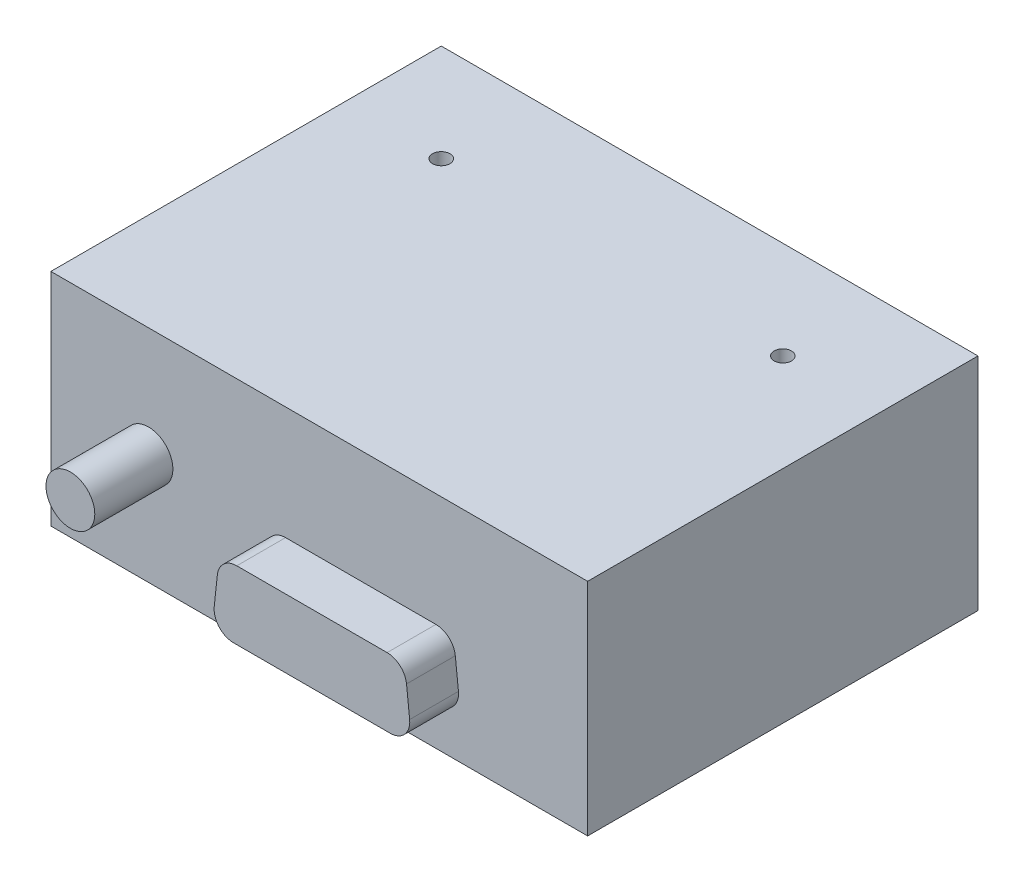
from build123d import *

# Parameters (mm, degrees)
SKETCH1_W                 = 69.85
SKETCH1_H                 = 28.702
EXTRUDE1_DEPTH            = 50.8
EXTRUDE2_DEPTH            = 6.35
SKETCH2_3_R               = 3.175
EXTRUDE3_DEPTH            = 10.16
F_4_40_TAPPED_HOLE3_D     = 2.2606
F_4_40_TAPPED_HOLE3_DEPTH = 8.89
F_4_40_TAPPED_HOLE3_TIP   = 0.679152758


with BuildPart() as part:
    # Sketch1 → Extrude1 (new body)
    with BuildSketch(Plane.XY):
        with Locations((34.925, 14.351)):
            Rectangle(SKETCH1_W, SKETCH1_H)
    extrude(amount=EXTRUDE1_DEPTH)

    # Sketch2 → Extrude2 (add)
    with BuildSketch(Plane.XY.offset(50.8)):
        with BuildLine():
            Line((52.630650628, 11.700594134), (53.038864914, 7.890594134))
            ThreePointArc((53.038864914, 7.890594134), (52.402619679, 5.922311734), (50.513319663, 5.08))
            Line((50.513319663, 5.08), (30.131680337, 5.08))
            ThreePointArc((30.131680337, 5.08), (28.242380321, 5.922311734), (27.606135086, 7.890594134))
            Line((27.606135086, 7.890594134), (28.014349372, 11.700594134))
            ThreePointArc((28.014349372, 11.700594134), (28.842206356, 13.319300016), (30.539894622, 13.97))
            Line((30.539894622, 13.97), (50.105105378, 13.97))
            ThreePointArc((50.105105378, 13.97), (51.802793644, 13.319300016), (52.630650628, 11.700594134))
        make_face()
    extrude(amount=EXTRUDE2_DEPTH)

    # Sketch2_3 → Extrude3 (add)
    with BuildSketch(Plane.XY.offset(50.8)):
        with Locations(Location((12.7, 14.351, 0), (0, 0, 180))):
            Circle(SKETCH2_3_R)
    extrude(amount=EXTRUDE3_DEPTH)

    # 4-40 Tapped Hole3
    with Locations(Plane(origin=(0, 28.702, 0), x_dir=(-1, 0, 0), z_dir=(0, 1, 0))):
        with Locations((-57.15, 12.7), (-12.7, 12.7)):
            Hole(F_4_40_TAPPED_HOLE3_D / 2, depth=F_4_40_TAPPED_HOLE3_DEPTH)
            with Locations((0, 0, -(F_4_40_TAPPED_HOLE3_DEPTH + F_4_40_TAPPED_HOLE3_TIP / 2))):  # 118° drill point
                Cone(0, F_4_40_TAPPED_HOLE3_D / 2, F_4_40_TAPPED_HOLE3_TIP, mode=Mode.SUBTRACT)


solid = part.part
